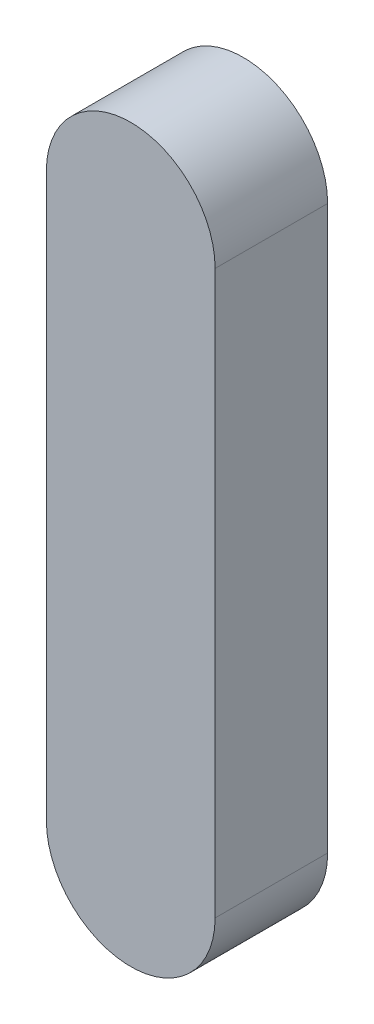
ISO-10303-21;
HEADER;
FILE_DESCRIPTION(('STEP AP214'),'2;1');
FILE_NAME('part.step','',(''),(''),'','','');
FILE_SCHEMA(('AUTOMOTIVE_DESIGN { 1 0 10303 214 1 1 1 1 }'));
ENDSEC;
DATA;
#1=APPLICATION_CONTEXT('core data for automotive mechanical design processes');
#2=APPLICATION_PROTOCOL_DEFINITION('international standard','automotive_design',2000,#1);
#3=PRODUCT_CONTEXT('',#1,'mechanical');
#4=PRODUCT('Part','Part','',(#3));
#5=PRODUCT_RELATED_PRODUCT_CATEGORY('part','',(#4));
#6=PRODUCT_DEFINITION_FORMATION('','',#4);
#7=PRODUCT_DEFINITION_CONTEXT('part definition',#1,'design');
#8=PRODUCT_DEFINITION('design','',#6,#7);
#9=PRODUCT_DEFINITION_SHAPE('','',#8);
#10=(LENGTH_UNIT() NAMED_UNIT(*) SI_UNIT(.MILLI.,.METRE.));
#11=(NAMED_UNIT(*) PLANE_ANGLE_UNIT() SI_UNIT($,.RADIAN.));
#12=(NAMED_UNIT(*) SI_UNIT($,.STERADIAN.) SOLID_ANGLE_UNIT());
#13=UNCERTAINTY_MEASURE_WITH_UNIT(LENGTH_MEASURE(1.E-05),#10,'distance_accuracy_value','');
#14=(GEOMETRIC_REPRESENTATION_CONTEXT(3) GLOBAL_UNCERTAINTY_ASSIGNED_CONTEXT((#13)) GLOBAL_UNIT_ASSIGNED_CONTEXT((#10,
#11,#12)) REPRESENTATION_CONTEXT('',''));
#15=CARTESIAN_POINT('',(0.,0.,0.));
#16=DIRECTION('',(0.,0.,1.));
#17=DIRECTION('',(1.,0.,0.));
#18=AXIS2_PLACEMENT_3D('',#15,#16,#17);
#19=CARTESIAN_POINT('',(4.5,-36.,4.));
#20=DIRECTION('',(0.,0.,-1.));
#21=DIRECTION('',(-1.,0.,0.));
#22=AXIS2_PLACEMENT_3D('',#19,#20,#21);
#23=CYLINDRICAL_SURFACE('',#22,3.);
#24=CARTESIAN_POINT('',(4.5,-36.,0.));
#25=DIRECTION('',(0.,0.,1.));
#26=DIRECTION('',(1.,0.,0.));
#27=AXIS2_PLACEMENT_3D('',#24,#25,#26);
#28=CIRCLE('',#27,3.);
#29=CARTESIAN_POINT('',(7.5,-36.,0.));
#30=VERTEX_POINT('',#29);
#31=CARTESIAN_POINT('',(1.5,-36.,0.));
#32=VERTEX_POINT('',#31);
#33=EDGE_CURVE('E94',#30,#32,#28,.T.);
#34=ORIENTED_EDGE('',*,*,#33,.T.);
#35=DIRECTION('',(0.,0.,-1.));
#36=VECTOR('',#35,1.);
#37=CARTESIAN_POINT('',(1.5,-36.,4.));
#38=LINE('',#37,#36);
#39=CARTESIAN_POINT('',(1.5,-36.,4.));
#40=VERTEX_POINT('',#39);
#41=EDGE_CURVE('E11',#40,#32,#38,.T.);
#42=ORIENTED_EDGE('',*,*,#41,.F.);
#43=CARTESIAN_POINT('',(4.5,-36.,4.));
#44=DIRECTION('',(0.,0.,1.));
#45=DIRECTION('',(1.,0.,0.));
#46=AXIS2_PLACEMENT_3D('',#43,#44,#45);
#47=CIRCLE('',#46,3.);
#48=CARTESIAN_POINT('',(7.5,-36.,4.));
#49=VERTEX_POINT('',#48);
#50=EDGE_CURVE('E82',#49,#40,#47,.T.);
#51=ORIENTED_EDGE('',*,*,#50,.F.);
#52=DIRECTION('',(0.,0.,-1.));
#53=VECTOR('',#52,1.);
#54=CARTESIAN_POINT('',(7.5,-36.,4.));
#55=LINE('',#54,#53);
#56=EDGE_CURVE('E90',#49,#30,#55,.T.);
#57=ORIENTED_EDGE('',*,*,#56,.T.);
#58=EDGE_LOOP('',(#34,#42,#51,#57));
#59=FACE_BOUND('',#58,.T.);
#60=ADVANCED_FACE('F31',(#59),#23,.T.);
#61=CARTESIAN_POINT('',(1.5,-36.,4.));
#62=DIRECTION('',(1.,0.,0.));
#63=DIRECTION('',(0.,0.,-1.));
#64=AXIS2_PLACEMENT_3D('',#61,#62,#63);
#65=PLANE('',#64);
#66=DIRECTION('',(0.,-1.,0.));
#67=VECTOR('',#66,1.);
#68=CARTESIAN_POINT('',(1.5,-36.,0.));
#69=LINE('',#68,#67);
#70=CARTESIAN_POINT('',(1.5,-56.,0.));
#71=VERTEX_POINT('',#70);
#72=EDGE_CURVE('E86',#32,#71,#69,.T.);
#73=ORIENTED_EDGE('',*,*,#72,.T.);
#74=DIRECTION('',(0.,0.,-1.));
#75=VECTOR('',#74,1.);
#76=CARTESIAN_POINT('',(1.5,-56.,4.));
#77=LINE('',#76,#75);
#78=CARTESIAN_POINT('',(1.5,-56.,4.));
#79=VERTEX_POINT('',#78);
#80=EDGE_CURVE('E39',#79,#71,#77,.T.);
#81=ORIENTED_EDGE('',*,*,#80,.F.);
#82=DIRECTION('',(0.,-1.,0.));
#83=VECTOR('',#82,1.);
#84=CARTESIAN_POINT('',(1.5,-36.,4.));
#85=LINE('',#84,#83);
#86=EDGE_CURVE('E77',#40,#79,#85,.T.);
#87=ORIENTED_EDGE('',*,*,#86,.F.);
#88=ORIENTED_EDGE('',*,*,#41,.T.);
#89=EDGE_LOOP('',(#73,#81,#87,#88));
#90=FACE_BOUND('',#89,.T.);
#91=ADVANCED_FACE('F85',(#90),#65,.F.);
#92=CARTESIAN_POINT('',(4.5,-56.,4.));
#93=DIRECTION('',(0.,0.,-1.));
#94=DIRECTION('',(-1.,0.,0.));
#95=AXIS2_PLACEMENT_3D('',#92,#93,#94);
#96=CYLINDRICAL_SURFACE('',#95,3.);
#97=CARTESIAN_POINT('',(4.5,-56.,0.));
#98=DIRECTION('',(0.,0.,1.));
#99=DIRECTION('',(1.,0.,0.));
#100=AXIS2_PLACEMENT_3D('',#97,#98,#99);
#101=CIRCLE('',#100,3.);
#102=CARTESIAN_POINT('',(7.5,-56.,0.));
#103=VERTEX_POINT('',#102);
#104=EDGE_CURVE('E64',#71,#103,#101,.T.);
#105=ORIENTED_EDGE('',*,*,#104,.T.);
#106=DIRECTION('',(0.,0.,-1.));
#107=VECTOR('',#106,1.);
#108=CARTESIAN_POINT('',(7.5,-56.,4.));
#109=LINE('',#108,#107);
#110=CARTESIAN_POINT('',(7.5,-56.,4.));
#111=VERTEX_POINT('',#110);
#112=EDGE_CURVE('E87',#111,#103,#109,.T.);
#113=ORIENTED_EDGE('',*,*,#112,.F.);
#114=CARTESIAN_POINT('',(4.5,-56.,4.));
#115=DIRECTION('',(0.,0.,1.));
#116=DIRECTION('',(1.,0.,0.));
#117=AXIS2_PLACEMENT_3D('',#114,#115,#116);
#118=CIRCLE('',#117,3.);
#119=EDGE_CURVE('E80',#79,#111,#118,.T.);
#120=ORIENTED_EDGE('',*,*,#119,.F.);
#121=ORIENTED_EDGE('',*,*,#80,.T.);
#122=EDGE_LOOP('',(#105,#113,#120,#121));
#123=FACE_BOUND('',#122,.T.);
#124=ADVANCED_FACE('F88',(#123),#96,.T.);
#125=CARTESIAN_POINT('',(7.5,-56.,4.));
#126=DIRECTION('',(-1.,0.,0.));
#127=DIRECTION('',(0.,-1.,0.));
#128=AXIS2_PLACEMENT_3D('',#125,#126,#127);
#129=PLANE('',#128);
#130=DIRECTION('',(0.,1.,0.));
#131=VECTOR('',#130,1.);
#132=CARTESIAN_POINT('',(7.5,-56.,0.));
#133=LINE('',#132,#131);
#134=EDGE_CURVE('E70',#103,#30,#133,.T.);
#135=ORIENTED_EDGE('',*,*,#134,.T.);
#136=ORIENTED_EDGE('',*,*,#56,.F.);
#137=DIRECTION('',(0.,1.,0.));
#138=VECTOR('',#137,1.);
#139=CARTESIAN_POINT('',(7.5,-56.,4.));
#140=LINE('',#139,#138);
#141=EDGE_CURVE('E47',#111,#49,#140,.T.);
#142=ORIENTED_EDGE('',*,*,#141,.F.);
#143=ORIENTED_EDGE('',*,*,#112,.T.);
#144=EDGE_LOOP('',(#135,#136,#142,#143));
#145=FACE_BOUND('',#144,.T.);
#146=ADVANCED_FACE('F101',(#145),#129,.F.);
#147=CARTESIAN_POINT('',(4.5,-36.,4.));
#148=DIRECTION('',(0.,0.,1.));
#149=DIRECTION('',(1.,0.,0.));
#150=AXIS2_PLACEMENT_3D('',#147,#148,#149);
#151=PLANE('',#150);
#152=ORIENTED_EDGE('',*,*,#50,.T.);
#153=ORIENTED_EDGE('',*,*,#86,.T.);
#154=ORIENTED_EDGE('',*,*,#119,.T.);
#155=ORIENTED_EDGE('',*,*,#141,.T.);
#156=EDGE_LOOP('',(#152,#153,#154,#155));
#157=FACE_BOUND('',#156,.T.);
#158=ADVANCED_FACE('F78',(#157),#151,.T.);
#159=CARTESIAN_POINT('',(4.5,-36.,0.));
#160=DIRECTION('',(0.,0.,1.));
#161=DIRECTION('',(1.,0.,0.));
#162=AXIS2_PLACEMENT_3D('',#159,#160,#161);
#163=PLANE('',#162);
#164=ORIENTED_EDGE('',*,*,#33,.F.);
#165=ORIENTED_EDGE('',*,*,#134,.F.);
#166=ORIENTED_EDGE('',*,*,#104,.F.);
#167=ORIENTED_EDGE('',*,*,#72,.F.);
#168=EDGE_LOOP('',(#164,#165,#166,#167));
#169=FACE_BOUND('',#168,.T.);
#170=ADVANCED_FACE('F104',(#169),#163,.F.);
#171=CLOSED_SHELL('',(#60,#91,#124,#146,#158,#170));
#172=MANIFOLD_SOLID_BREP('B2',#171);
#173=ADVANCED_BREP_SHAPE_REPRESENTATION('',(#18,#172),#14);
#174=SHAPE_DEFINITION_REPRESENTATION(#9,#173);
ENDSEC;
END-ISO-10303-21;
